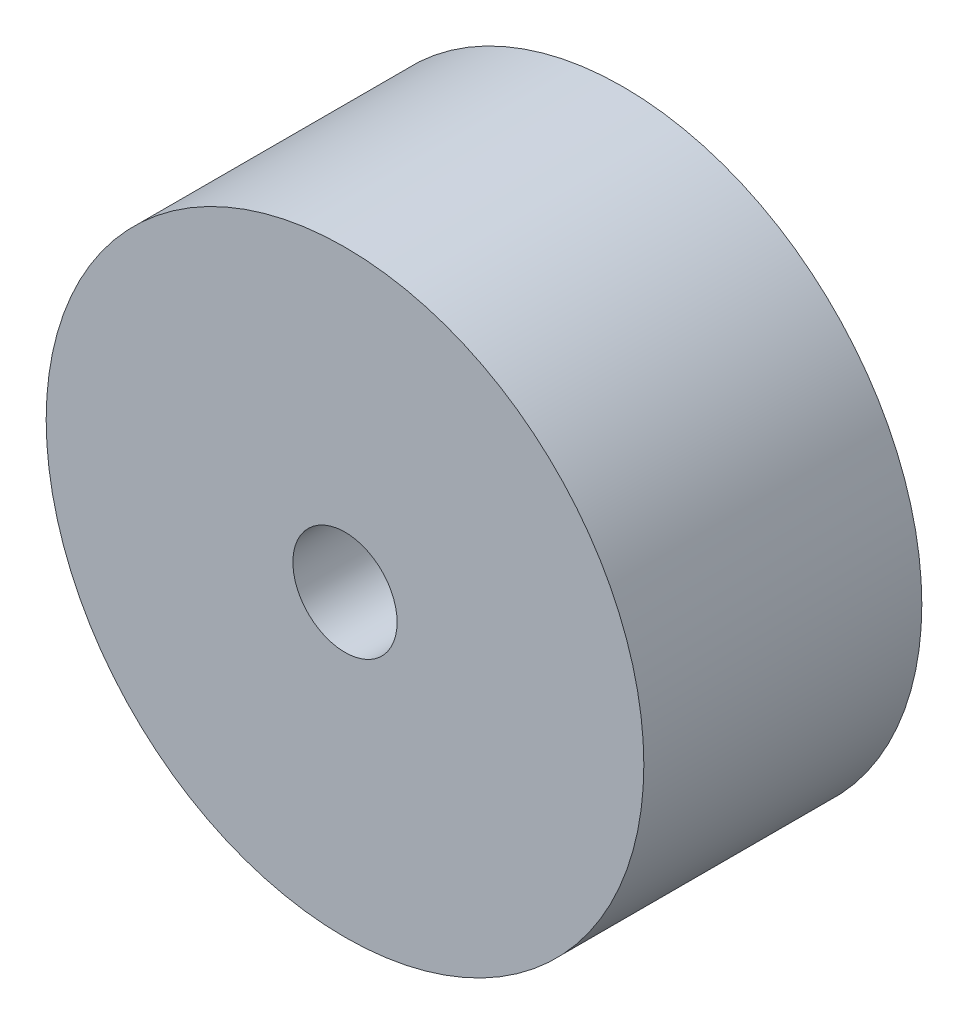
from build123d import *

# Parameters (mm, degrees)
ESQUISSE1_R        = 43
ESQUISSE1_R_2      = 7.5
BOSS_EXTRU_1_DEPTH = 40


with BuildPart() as part:
    # Esquisse1 → Boss.-Extru.1 (new body)
    with BuildSketch(Plane.XY):
        Circle(ESQUISSE1_R)
        Circle(ESQUISSE1_R_2, mode=Mode.SUBTRACT)
    extrude(amount=BOSS_EXTRU_1_DEPTH)


solid = part.part
